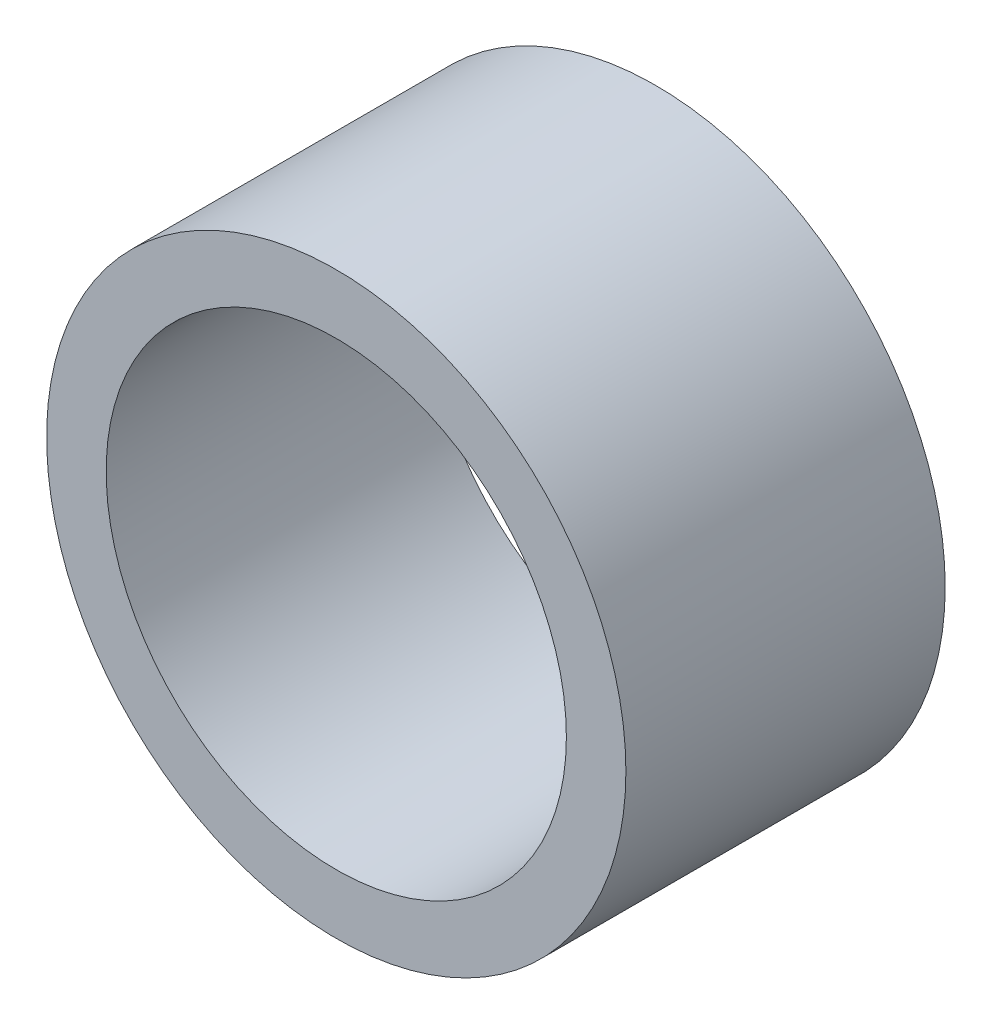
from build123d import *

# Parameters (mm, degrees)
SKETCH1_R      = 6.35
SKETCH1_R_2    = 5.045
EXTRUDE1_DEPTH = 7


with BuildPart() as part:
    # Sketch1 → Extrude1 (new body)
    with BuildSketch(Plane.XY):
        Circle(SKETCH1_R)
        Circle(SKETCH1_R_2, mode=Mode.SUBTRACT)
    extrude(amount=-EXTRUDE1_DEPTH)


solid = part.part
